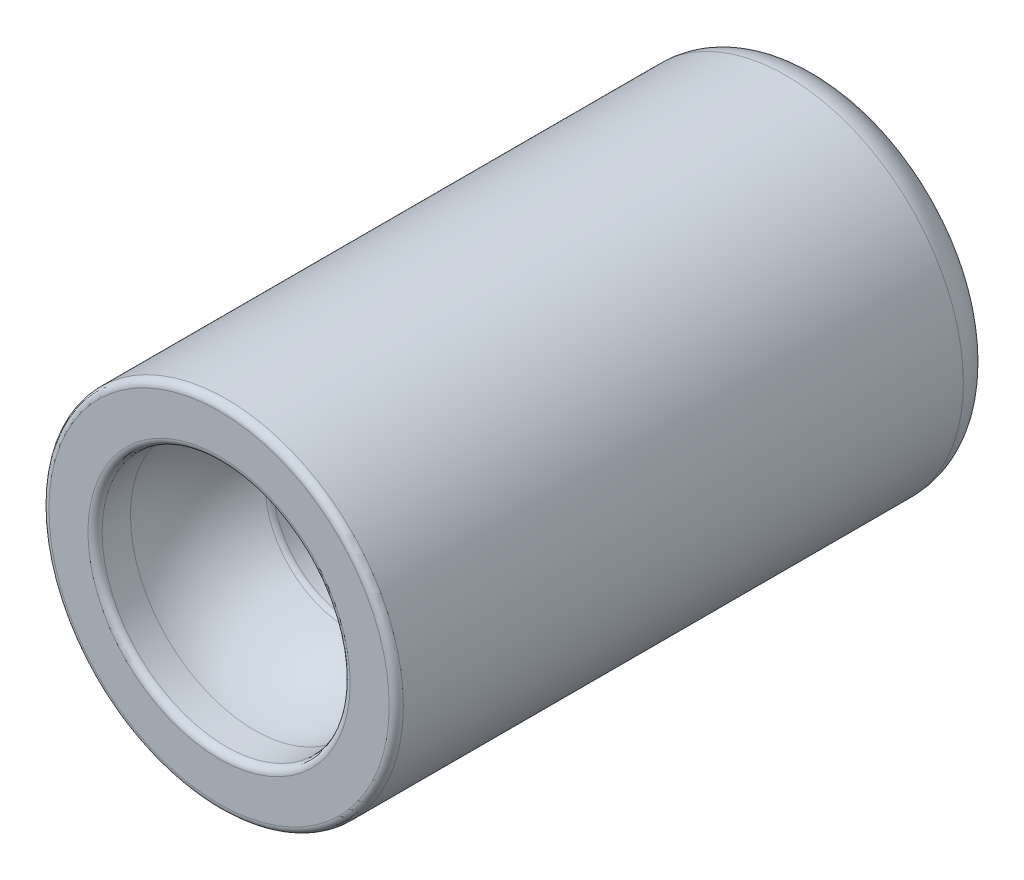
ISO-10303-21;
HEADER;
FILE_DESCRIPTION(('STEP AP214'),'2;1');
FILE_NAME('part.step','',(''),(''),'','','');
FILE_SCHEMA(('AUTOMOTIVE_DESIGN { 1 0 10303 214 1 1 1 1 }'));
ENDSEC;
DATA;
#1=APPLICATION_CONTEXT('core data for automotive mechanical design processes');
#2=APPLICATION_PROTOCOL_DEFINITION('international standard','automotive_design',2000,#1);
#3=PRODUCT_CONTEXT('',#1,'mechanical');
#4=PRODUCT('Part','Part','',(#3));
#5=PRODUCT_RELATED_PRODUCT_CATEGORY('part','',(#4));
#6=PRODUCT_DEFINITION_FORMATION('','',#4);
#7=PRODUCT_DEFINITION_CONTEXT('part definition',#1,'design');
#8=PRODUCT_DEFINITION('design','',#6,#7);
#9=PRODUCT_DEFINITION_SHAPE('','',#8);
#10=(LENGTH_UNIT() NAMED_UNIT(*) SI_UNIT(.MILLI.,.METRE.));
#11=(NAMED_UNIT(*) PLANE_ANGLE_UNIT() SI_UNIT($,.RADIAN.));
#12=(NAMED_UNIT(*) SI_UNIT($,.STERADIAN.) SOLID_ANGLE_UNIT());
#13=UNCERTAINTY_MEASURE_WITH_UNIT(LENGTH_MEASURE(1.E-05),#10,'distance_accuracy_value','');
#14=(GEOMETRIC_REPRESENTATION_CONTEXT(3) GLOBAL_UNCERTAINTY_ASSIGNED_CONTEXT((#13)) GLOBAL_UNIT_ASSIGNED_CONTEXT((#10,
#11,#12)) REPRESENTATION_CONTEXT('',''));
#15=CARTESIAN_POINT('',(0.,0.,0.));
#16=DIRECTION('',(0.,0.,1.));
#17=DIRECTION('',(1.,0.,0.));
#18=AXIS2_PLACEMENT_3D('',#15,#16,#17);
#19=CARTESIAN_POINT('',(0.,5.,0.));
#20=DIRECTION('',(0.,0.,-1.));
#21=DIRECTION('',(-1.,0.,0.));
#22=AXIS2_PLACEMENT_3D('',#19,#20,#21);
#23=PLANE('',#22);
#24=CARTESIAN_POINT('',(0.,0.,0.));
#25=DIRECTION('',(0.,0.,-1.));
#26=DIRECTION('',(-1.,0.,0.));
#27=AXIS2_PLACEMENT_3D('',#24,#25,#26);
#28=CIRCLE('',#27,3.7);
#29=CARTESIAN_POINT('',(-3.7,0.,0.));
#30=VERTEX_POINT('',#29);
#31=EDGE_CURVE('E57',#30,#30,#28,.T.);
#32=ORIENTED_EDGE('',*,*,#31,.T.);
#33=EDGE_LOOP('',(#32));
#34=FACE_BOUND('',#33,.T.);
#35=CARTESIAN_POINT('',(0.,0.,0.));
#36=DIRECTION('',(0.,0.,-1.));
#37=DIRECTION('',(-1.,0.,0.));
#38=AXIS2_PLACEMENT_3D('',#35,#36,#37);
#39=CIRCLE('',#38,4.8);
#40=CARTESIAN_POINT('',(-4.8,0.,0.));
#41=VERTEX_POINT('',#40);
#42=EDGE_CURVE('E60',#41,#41,#39,.F.);
#43=ORIENTED_EDGE('',*,*,#42,.T.);
#44=EDGE_LOOP('',(#43));
#45=FACE_BOUND('',#44,.T.);
#46=ADVANCED_FACE('F29',(#34,#45),#23,.F.);
#47=CARTESIAN_POINT('',(0.,0.,0.));
#48=DIRECTION('',(0.,0.,1.));
#49=DIRECTION('',(1.,0.,0.));
#50=AXIS2_PLACEMENT_3D('',#47,#48,#49);
#51=CYLINDRICAL_SURFACE('',#50,3.5);
#52=CARTESIAN_POINT('',(0.,0.,-0.2));
#53=DIRECTION('',(0.,0.,-1.));
#54=DIRECTION('',(-1.,0.,0.));
#55=AXIS2_PLACEMENT_3D('',#52,#53,#54);
#56=CIRCLE('',#55,3.5);
#57=CARTESIAN_POINT('',(-3.5,0.,-0.2));
#58=VERTEX_POINT('',#57);
#59=EDGE_CURVE('E63',#58,#58,#56,.F.);
#60=ORIENTED_EDGE('',*,*,#59,.T.);
#61=EDGE_LOOP('',(#60));
#62=FACE_BOUND('',#61,.T.);
#63=CARTESIAN_POINT('',(0.,0.,-0.999999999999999));
#64=DIRECTION('',(0.,0.,1.));
#65=DIRECTION('',(1.,0.,0.));
#66=AXIS2_PLACEMENT_3D('',#63,#64,#65);
#67=CIRCLE('',#66,3.5);
#68=CARTESIAN_POINT('',(3.5,0.,-0.999999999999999));
#69=VERTEX_POINT('',#68);
#70=EDGE_CURVE('E66',#69,#69,#67,.T.);
#71=ORIENTED_EDGE('',*,*,#70,.F.);
#72=EDGE_LOOP('',(#71));
#73=FACE_BOUND('',#72,.T.);
#74=ADVANCED_FACE('F98',(#62,#73),#51,.F.);
#75=CARTESIAN_POINT('',(0.,0.,-1.));
#76=DIRECTION('',(0.,0.,1.));
#77=DIRECTION('',(0.,1.,0.));
#78=AXIS2_PLACEMENT_3D('',#75,#76,#77);
#79=SPHERICAL_SURFACE('',#78,3.5);
#80=CARTESIAN_POINT('',(0.,0.,-3.62276201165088));
#81=DIRECTION('',(0.,0.,1.));
#82=DIRECTION('',(1.,0.,0.));
#83=AXIS2_PLACEMENT_3D('',#80,#81,#82);
#84=CIRCLE('',#83,2.31756756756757);
#85=CARTESIAN_POINT('',(2.31756756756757,0.,-3.62276201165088));
#86=VERTEX_POINT('',#85);
#87=EDGE_CURVE('E48',#86,#86,#84,.F.);
#88=ORIENTED_EDGE('',*,*,#87,.T.);
#89=EDGE_LOOP('',(#88));
#90=FACE_BOUND('',#89,.T.);
#91=ORIENTED_EDGE('',*,*,#70,.T.);
#92=EDGE_LOOP('',(#91));
#93=FACE_BOUND('',#92,.T.);
#94=ADVANCED_FACE('F103',(#90,#93),#79,.F.);
#95=CARTESIAN_POINT('',(0.,0.,0.));
#96=DIRECTION('',(0.,0.,1.));
#97=DIRECTION('',(1.,0.,0.));
#98=AXIS2_PLACEMENT_3D('',#95,#96,#97);
#99=CYLINDRICAL_SURFACE('',#98,2.25);
#100=CARTESIAN_POINT('',(0.,0.,-3.77263412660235));
#101=DIRECTION('',(0.,0.,1.));
#102=DIRECTION('',(1.,0.,0.));
#103=AXIS2_PLACEMENT_3D('',#100,#101,#102);
#104=CIRCLE('',#103,2.25);
#105=CARTESIAN_POINT('',(2.25,0.,-3.77263412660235));
#106=VERTEX_POINT('',#105);
#107=EDGE_CURVE('E51',#106,#106,#104,.T.);
#108=ORIENTED_EDGE('',*,*,#107,.T.);
#109=EDGE_LOOP('',(#108));
#110=FACE_BOUND('',#109,.T.);
#111=CARTESIAN_POINT('',(0.,0.,-9.72736587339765));
#112=DIRECTION('',(0.,0.,-1.));
#113=DIRECTION('',(-1.,0.,0.));
#114=AXIS2_PLACEMENT_3D('',#111,#112,#113);
#115=CIRCLE('',#114,2.25);
#116=CARTESIAN_POINT('',(-2.25,0.,-9.72736587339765));
#117=VERTEX_POINT('',#116);
#118=EDGE_CURVE('E54',#117,#117,#115,.T.);
#119=ORIENTED_EDGE('',*,*,#118,.T.);
#120=EDGE_LOOP('',(#119));
#121=FACE_BOUND('',#120,.T.);
#122=ADVANCED_FACE('F188',(#110,#121),#99,.F.);
#123=CARTESIAN_POINT('',(0.,0.,-12.5));
#124=DIRECTION('',(0.,0.,1.));
#125=DIRECTION('',(0.,1.,0.));
#126=AXIS2_PLACEMENT_3D('',#123,#124,#125);
#127=SPHERICAL_SURFACE('',#126,3.5);
#128=CARTESIAN_POINT('',(0.,0.,-9.87723798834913));
#129=DIRECTION('',(0.,0.,-1.));
#130=DIRECTION('',(-1.,0.,0.));
#131=AXIS2_PLACEMENT_3D('',#128,#129,#130);
#132=CIRCLE('',#131,2.31756756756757);
#133=CARTESIAN_POINT('',(-2.31756756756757,0.,-9.87723798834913));
#134=VERTEX_POINT('',#133);
#135=EDGE_CURVE('E43',#134,#134,#132,.F.);
#136=ORIENTED_EDGE('',*,*,#135,.T.);
#137=EDGE_LOOP('',(#136));
#138=FACE_BOUND('',#137,.T.);
#139=CARTESIAN_POINT('',(0.,0.,-12.5));
#140=DIRECTION('',(0.,0.,1.));
#141=DIRECTION('',(1.,0.,0.));
#142=AXIS2_PLACEMENT_3D('',#139,#140,#141);
#143=CIRCLE('',#142,3.5);
#144=CARTESIAN_POINT('',(3.5,0.,-12.5));
#145=VERTEX_POINT('',#144);
#146=EDGE_CURVE('E69',#145,#145,#143,.T.);
#147=ORIENTED_EDGE('',*,*,#146,.F.);
#148=EDGE_LOOP('',(#147));
#149=FACE_BOUND('',#148,.T.);
#150=ADVANCED_FACE('F95',(#138,#149),#127,.F.);
#151=CARTESIAN_POINT('',(0.,0.,0.));
#152=DIRECTION('',(0.,0.,1.));
#153=DIRECTION('',(1.,0.,0.));
#154=AXIS2_PLACEMENT_3D('',#151,#152,#153);
#155=CYLINDRICAL_SURFACE('',#154,3.5);
#156=CARTESIAN_POINT('',(0.,0.,-16.8));
#157=DIRECTION('',(0.,0.,1.));
#158=DIRECTION('',(1.,0.,0.));
#159=AXIS2_PLACEMENT_3D('',#156,#157,#158);
#160=CIRCLE('',#159,3.5);
#161=CARTESIAN_POINT('',(3.5,0.,-16.8));
#162=VERTEX_POINT('',#161);
#163=EDGE_CURVE('E35',#162,#162,#160,.F.);
#164=ORIENTED_EDGE('',*,*,#163,.T.);
#165=EDGE_LOOP('',(#164));
#166=FACE_BOUND('',#165,.T.);
#167=ORIENTED_EDGE('',*,*,#146,.T.);
#168=EDGE_LOOP('',(#167));
#169=FACE_BOUND('',#168,.T.);
#170=ADVANCED_FACE('F89',(#166,#169),#155,.F.);
#171=CARTESIAN_POINT('',(0.,4.,-17.));
#172=DIRECTION('',(0.,0.,1.));
#173=DIRECTION('',(1.,0.,0.));
#174=AXIS2_PLACEMENT_3D('',#171,#172,#173);
#175=PLANE('',#174);
#176=CARTESIAN_POINT('',(0.,0.,-17.));
#177=DIRECTION('',(0.,0.,1.));
#178=DIRECTION('',(1.,0.,0.));
#179=AXIS2_PLACEMENT_3D('',#176,#177,#178);
#180=CIRCLE('',#179,3.7);
#181=CARTESIAN_POINT('',(3.7,0.,-17.));
#182=VERTEX_POINT('',#181);
#183=EDGE_CURVE('E39',#182,#182,#180,.T.);
#184=ORIENTED_EDGE('',*,*,#183,.T.);
#185=EDGE_LOOP('',(#184));
#186=FACE_BOUND('',#185,.T.);
#187=CARTESIAN_POINT('',(0.,0.,-17.));
#188=DIRECTION('',(0.,0.,1.));
#189=DIRECTION('',(1.,0.,0.));
#190=AXIS2_PLACEMENT_3D('',#187,#188,#189);
#191=CIRCLE('',#190,4.);
#192=CARTESIAN_POINT('',(4.,0.,-17.));
#193=VERTEX_POINT('',#192);
#194=EDGE_CURVE('E72',#193,#193,#191,.T.);
#195=ORIENTED_EDGE('',*,*,#194,.F.);
#196=EDGE_LOOP('',(#195));
#197=FACE_BOUND('',#196,.T.);
#198=ADVANCED_FACE('F84',(#186,#197),#175,.F.);
#199=CARTESIAN_POINT('',(0.,0.,-16.));
#200=DIRECTION('',(0.,0.,1.));
#201=DIRECTION('',(1.,0.,0.));
#202=AXIS2_PLACEMENT_3D('',#199,#200,#201);
#203=TOROIDAL_SURFACE('',#202,4.,1.);
#204=CARTESIAN_POINT('',(0.,0.,-16.));
#205=DIRECTION('',(0.,0.,1.));
#206=DIRECTION('',(1.,0.,0.));
#207=AXIS2_PLACEMENT_3D('',#204,#205,#206);
#208=CIRCLE('',#207,5.);
#209=CARTESIAN_POINT('',(5.,0.,-16.));
#210=VERTEX_POINT('',#209);
#211=EDGE_CURVE('E75',#210,#210,#208,.T.);
#212=ORIENTED_EDGE('',*,*,#211,.F.);
#213=EDGE_LOOP('',(#212));
#214=FACE_BOUND('',#213,.T.);
#215=ORIENTED_EDGE('',*,*,#194,.T.);
#216=EDGE_LOOP('',(#215));
#217=FACE_BOUND('',#216,.T.);
#218=ADVANCED_FACE('F81',(#214,#217),#203,.T.);
#219=CARTESIAN_POINT('',(0.,0.,0.));
#220=DIRECTION('',(0.,0.,1.));
#221=DIRECTION('',(1.,0.,0.));
#222=AXIS2_PLACEMENT_3D('',#219,#220,#221);
#223=CYLINDRICAL_SURFACE('',#222,5.);
#224=CARTESIAN_POINT('',(0.,0.,-0.2));
#225=DIRECTION('',(0.,0.,-1.));
#226=DIRECTION('',(-1.,0.,0.));
#227=AXIS2_PLACEMENT_3D('',#224,#225,#226);
#228=CIRCLE('',#227,5.);
#229=CARTESIAN_POINT('',(-5.,0.,-0.2));
#230=VERTEX_POINT('',#229);
#231=EDGE_CURVE('E10',#230,#230,#228,.T.);
#232=ORIENTED_EDGE('',*,*,#231,.T.);
#233=EDGE_LOOP('',(#232));
#234=FACE_BOUND('',#233,.T.);
#235=ORIENTED_EDGE('',*,*,#211,.T.);
#236=EDGE_LOOP('',(#235));
#237=FACE_BOUND('',#236,.T.);
#238=ADVANCED_FACE('F79',(#234,#237),#223,.T.);
#239=CARTESIAN_POINT('',(0.,0.,-0.2));
#240=DIRECTION('',(0.,0.,-1.));
#241=DIRECTION('',(-1.,0.,0.));
#242=AXIS2_PLACEMENT_3D('',#239,#240,#241);
#243=TOROIDAL_SURFACE('',#242,3.7,0.2);
#244=ORIENTED_EDGE('',*,*,#31,.F.);
#245=EDGE_LOOP('',(#244));
#246=FACE_BOUND('',#245,.T.);
#247=ORIENTED_EDGE('',*,*,#59,.F.);
#248=EDGE_LOOP('',(#247));
#249=FACE_BOUND('',#248,.T.);
#250=ADVANCED_FACE('F127',(#246,#249),#243,.T.);
#251=CARTESIAN_POINT('',(0.,0.,-3.77263412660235));
#252=DIRECTION('',(0.,0.,1.));
#253=DIRECTION('',(1.,0.,0.));
#254=AXIS2_PLACEMENT_3D('',#251,#252,#253);
#255=TOROIDAL_SURFACE('',#254,2.45,0.2);
#256=ORIENTED_EDGE('',*,*,#87,.F.);
#257=EDGE_LOOP('',(#256));
#258=FACE_BOUND('',#257,.T.);
#259=ORIENTED_EDGE('',*,*,#107,.F.);
#260=EDGE_LOOP('',(#259));
#261=FACE_BOUND('',#260,.T.);
#262=ADVANCED_FACE('F123',(#258,#261),#255,.T.);
#263=CARTESIAN_POINT('',(0.,0.,-9.72736587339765));
#264=DIRECTION('',(0.,0.,-1.));
#265=DIRECTION('',(-1.,0.,0.));
#266=AXIS2_PLACEMENT_3D('',#263,#264,#265);
#267=TOROIDAL_SURFACE('',#266,2.45,0.2);
#268=ORIENTED_EDGE('',*,*,#118,.F.);
#269=EDGE_LOOP('',(#268));
#270=FACE_BOUND('',#269,.T.);
#271=ORIENTED_EDGE('',*,*,#135,.F.);
#272=EDGE_LOOP('',(#271));
#273=FACE_BOUND('',#272,.T.);
#274=ADVANCED_FACE('F117',(#270,#273),#267,.T.);
#275=CARTESIAN_POINT('',(0.,0.,-16.8));
#276=DIRECTION('',(0.,0.,1.));
#277=DIRECTION('',(1.,0.,0.));
#278=AXIS2_PLACEMENT_3D('',#275,#276,#277);
#279=TOROIDAL_SURFACE('',#278,3.7,0.2);
#280=ORIENTED_EDGE('',*,*,#163,.F.);
#281=EDGE_LOOP('',(#280));
#282=FACE_BOUND('',#281,.T.);
#283=ORIENTED_EDGE('',*,*,#183,.F.);
#284=EDGE_LOOP('',(#283));
#285=FACE_BOUND('',#284,.T.);
#286=ADVANCED_FACE('F111',(#282,#285),#279,.T.);
#287=CARTESIAN_POINT('',(0.,0.,-0.2));
#288=DIRECTION('',(0.,0.,-1.));
#289=DIRECTION('',(-1.,0.,0.));
#290=AXIS2_PLACEMENT_3D('',#287,#288,#289);
#291=TOROIDAL_SURFACE('',#290,4.8,0.2);
#292=ORIENTED_EDGE('',*,*,#231,.F.);
#293=EDGE_LOOP('',(#292));
#294=FACE_BOUND('',#293,.T.);
#295=ORIENTED_EDGE('',*,*,#42,.F.);
#296=EDGE_LOOP('',(#295));
#297=FACE_BOUND('',#296,.T.);
#298=ADVANCED_FACE('F109',(#294,#297),#291,.T.);
#299=CLOSED_SHELL('',(#46,#74,#94,#122,#150,#170,#198,#218,#238,#250,#262,#274,#286,#298));
#300=MANIFOLD_SOLID_BREP('B2',#299);
#301=ADVANCED_BREP_SHAPE_REPRESENTATION('',(#18,#300),#14);
#302=SHAPE_DEFINITION_REPRESENTATION(#9,#301);
ENDSEC;
END-ISO-10303-21;
